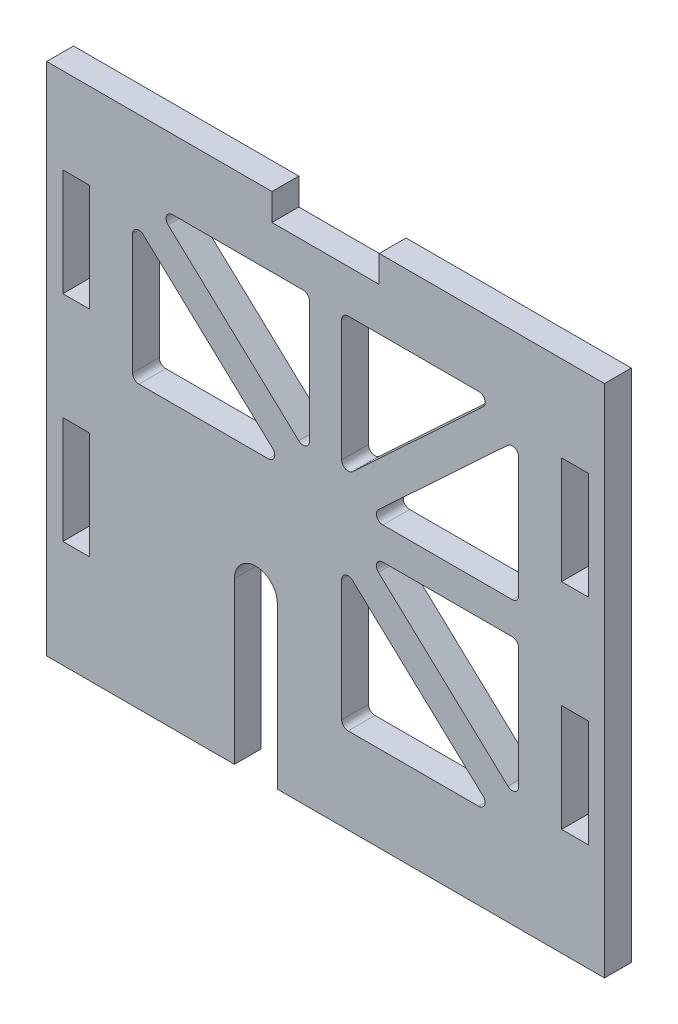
from build123d import *

# Parameters (mm, degrees)
SKETCH_1_W          = 52
SKETCH_1_H          = 48
EXTRUDE_1_DEPTH     = 2.5
SKETCH_2_W          = 2.5
SKETCH_2_H          = 10
CUT_EXTRUDE_1_DEPTH = 2.5
CUT_EXTRUDE_2_DEPTH = 2.5
SKETCH_4_W          = 10
SKETCH_4_H          = 2.5
CUT_EXTRUDE_3_DEPTH = 2.5
CUT_EXTRUDE_5_DEPTH = 10


with BuildPart() as part:
    # Sketch 1 → Extrude 1 (new body)
    with BuildSketch(Plane.XY):
        with Locations((0, 24)):
            Rectangle(SKETCH_1_W, SKETCH_1_H)
    extrude(amount=EXTRUDE_1_DEPTH)

    # Sketch 2 → Cut-Extrude 1 (cut)
    with BuildSketch(Plane.XY.offset(2.5)):
        with Locations((23.25, 35)):
            Rectangle(SKETCH_2_W, SKETCH_2_H)
        with Locations((23.25, 15)):
            Rectangle(SKETCH_2_W, SKETCH_2_H)
        with Locations((-23.25, 15)):
            Rectangle(SKETCH_2_W, SKETCH_2_H)
        with Locations((-23.25, 35)):
            Rectangle(SKETCH_2_W, SKETCH_2_H)
    extrude(amount=-CUT_EXTRUDE_1_DEPTH, mode=Mode.SUBTRACT)

    # Sketch 3 → Cut-Extrude 2 (cut)
    with BuildSketch(Plane(origin=(0, 0, 0), x_dir=(-1, 0, 0), z_dir=(0, 0, -1))):
        with BuildLine():
            Line((8.5, 0), (4.5, 0))
            Line((4.5, 0), (4.5, 15))
            ThreePointArc((4.5, 15), (6.5, 17), (8.5, 15))
            Line((8.5, 15), (8.5, 0))
        make_face()
    extrude(amount=-CUT_EXTRUDE_2_DEPTH, mode=Mode.SUBTRACT)

    # Sketch 4 → Cut-Extrude 3 (cut)
    with BuildSketch(Plane.XY.offset(2.5)):
        with Locations((0, 46.75)):
            Rectangle(SKETCH_4_W, SKETCH_4_H)
    extrude(amount=-CUT_EXTRUDE_3_DEPTH, mode=Mode.SUBTRACT)

    # Sketch 5 → Cut-Extrude 5 (cut)
    with BuildSketch(Plane.XY.offset(2.5)):
        with BuildLine():
            ThreePointArc((-2.1, 41.5), (-1.675735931, 41.324264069), (-1.5, 40.9))
            Line((-1.5, 40.9), (-1.5, 29.572749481))
            ThreePointArc((-1.5, 29.572749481), (-1.860461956, 29.022639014), (-2.508738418, 29.133508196))
            Line((-2.508738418, 29.133508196), (-14.68130614, 40.460758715))
            ThreePointArc((-14.68130614, 40.460758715), (-14.830933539, 41.119607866), (-14.272567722, 41.5))
            Line((-14.272567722, 41.5), (-2.1, 41.5))
        make_face()
        with BuildLine():
            Line((2.508738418, 29.133508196), (14.68130614, 40.460758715))
            ThreePointArc((14.68130614, 40.460758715), (14.830933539, 41.119607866), (14.272567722, 41.5))
            Line((14.272567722, 41.5), (2.1, 41.5))
            ThreePointArc((2.1, 41.5), (1.675735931, 41.324264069), (1.5, 40.9))
            Line((1.5, 40.9), (1.5, 29.572749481))
            ThreePointArc((1.5, 29.572749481), (1.860461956, 29.022639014), (2.508738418, 29.133508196))
        make_face()
        with BuildLine():
            ThreePointArc((4.930634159, 22.210758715), (4.78100676, 22.869607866), (5.339372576, 23.25))
            Line((5.339372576, 23.25), (17.4, 23.25))
            ThreePointArc((17.4, 23.25), (17.824264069, 23.074264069), (18, 22.65))
            Line((18, 22.65), (18, 11.426916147))
            ThreePointArc((18, 11.426916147), (17.639538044, 10.876805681), (16.991261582, 10.987674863))
            Line((16.991261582, 10.987674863), (4.930634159, 22.210758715))
        make_face()
        with BuildLine():
            ThreePointArc((2.1, 8), (1.675735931, 8.175735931), (1.5, 8.6))
            Line((1.5, 8.6), (1.5, 19.927250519))
            ThreePointArc((1.5, 19.927250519), (1.860461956, 20.477360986), (2.508738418, 20.366491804))
            Line((2.508738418, 20.366491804), (14.68130614, 9.039241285))
            ThreePointArc((14.68130614, 9.039241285), (14.830933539, 8.380392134), (14.272567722, 8))
            Line((14.272567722, 8), (2.1, 8))
        make_face()
        with BuildLine():
            ThreePointArc((16.991261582, 38.512325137), (17.639538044, 38.623194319), (18, 38.073083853))
            Line((18, 38.073083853), (18, 26.85))
            ThreePointArc((18, 26.85), (17.824264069, 26.425735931), (17.4, 26.25))
            Line((17.4, 26.25), (5.339372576, 26.25))
            ThreePointArc((5.339372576, 26.25), (4.78100676, 26.630392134), (4.930634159, 27.289241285))
            Line((4.930634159, 27.289241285), (16.991261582, 38.512325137))
        make_face()
        with BuildLine():
            Line((-4.930634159, 27.289241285), (-16.991261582, 38.512325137))
            ThreePointArc((-16.991261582, 38.512325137), (-17.639538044, 38.623194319), (-18, 38.073083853))
            Line((-18, 38.073083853), (-18, 26.85))
            ThreePointArc((-18, 26.85), (-17.824264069, 26.425735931), (-17.4, 26.25))
            Line((-17.4, 26.25), (-5.339372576, 26.25))
            ThreePointArc((-5.339372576, 26.25), (-4.78100676, 26.630392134), (-4.930634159, 27.289241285))
        make_face()
    extrude(amount=-CUT_EXTRUDE_5_DEPTH, mode=Mode.SUBTRACT)


solid = part.part
